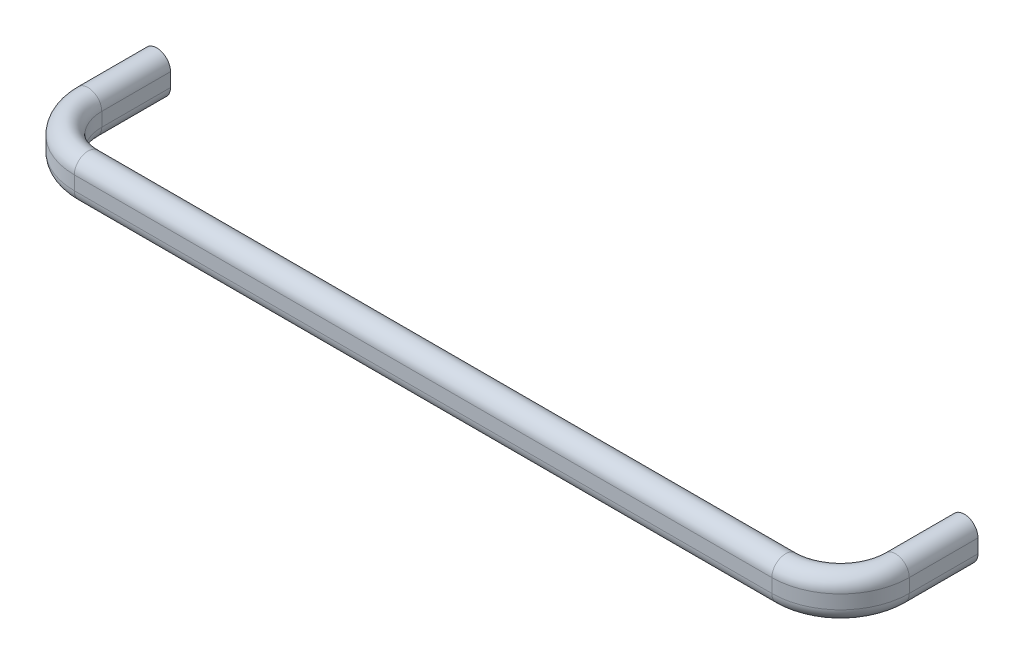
ISO-10303-21;
HEADER;
FILE_DESCRIPTION(('STEP AP214'),'2;1');
FILE_NAME('part.step','',(''),(''),'','','');
FILE_SCHEMA(('AUTOMOTIVE_DESIGN { 1 0 10303 214 1 1 1 1 }'));
ENDSEC;
DATA;
#1=APPLICATION_CONTEXT('core data for automotive mechanical design processes');
#2=APPLICATION_PROTOCOL_DEFINITION('international standard','automotive_design',2000,#1);
#3=PRODUCT_CONTEXT('',#1,'mechanical');
#4=PRODUCT('Part','Part','',(#3));
#5=PRODUCT_RELATED_PRODUCT_CATEGORY('part','',(#4));
#6=PRODUCT_DEFINITION_FORMATION('','',#4);
#7=PRODUCT_DEFINITION_CONTEXT('part definition',#1,'design');
#8=PRODUCT_DEFINITION('design','',#6,#7);
#9=PRODUCT_DEFINITION_SHAPE('','',#8);
#10=(LENGTH_UNIT() NAMED_UNIT(*) SI_UNIT(.MILLI.,.METRE.));
#11=(NAMED_UNIT(*) PLANE_ANGLE_UNIT() SI_UNIT($,.RADIAN.));
#12=(NAMED_UNIT(*) SI_UNIT($,.STERADIAN.) SOLID_ANGLE_UNIT());
#13=UNCERTAINTY_MEASURE_WITH_UNIT(LENGTH_MEASURE(1.E-05),#10,'distance_accuracy_value','');
#14=(GEOMETRIC_REPRESENTATION_CONTEXT(3) GLOBAL_UNCERTAINTY_ASSIGNED_CONTEXT((#13)) GLOBAL_UNIT_ASSIGNED_CONTEXT((#10,
#11,#12)) REPRESENTATION_CONTEXT('',''));
#15=CARTESIAN_POINT('',(0.,0.,0.));
#16=DIRECTION('',(0.,0.,1.));
#17=DIRECTION('',(1.,0.,0.));
#18=AXIS2_PLACEMENT_3D('',#15,#16,#17);
#19=CARTESIAN_POINT('',(0.,2.,0.));
#20=DIRECTION('',(0.,0.,-1.));
#21=DIRECTION('',(0.,1.,0.));
#22=AXIS2_PLACEMENT_3D('',#19,#20,#21);
#23=PLANE('',#22);
#24=CARTESIAN_POINT('',(0.,2.,0.));
#25=DIRECTION('',(0.,0.,-1.));
#26=DIRECTION('',(0.,1.,0.));
#27=AXIS2_PLACEMENT_3D('',#24,#25,#26);
#28=CIRCLE('',#27,4.);
#29=CARTESIAN_POINT('',(-4.,2.,0.));
#30=VERTEX_POINT('',#29);
#31=CARTESIAN_POINT('',(4.,2.,0.));
#32=VERTEX_POINT('',#31);
#33=EDGE_CURVE('E31',#30,#32,#28,.T.);
#34=ORIENTED_EDGE('',*,*,#33,.T.);
#35=DIRECTION('',(0.,-1.,0.));
#36=VECTOR('',#35,1.);
#37=CARTESIAN_POINT('',(4.,2.,0.));
#38=LINE('',#37,#36);
#39=CARTESIAN_POINT('',(4.,-2.,0.));
#40=VERTEX_POINT('',#39);
#41=EDGE_CURVE('E18',#32,#40,#38,.T.);
#42=ORIENTED_EDGE('',*,*,#41,.T.);
#43=CARTESIAN_POINT('',(0.,-2.,0.));
#44=DIRECTION('',(0.,0.,-1.));
#45=DIRECTION('',(0.,1.,0.));
#46=AXIS2_PLACEMENT_3D('',#43,#44,#45);
#47=CIRCLE('',#46,4.);
#48=CARTESIAN_POINT('',(-4.,-2.,0.));
#49=VERTEX_POINT('',#48);
#50=EDGE_CURVE('E39',#40,#49,#47,.T.);
#51=ORIENTED_EDGE('',*,*,#50,.T.);
#52=DIRECTION('',(0.,-1.,0.));
#53=VECTOR('',#52,1.);
#54=CARTESIAN_POINT('',(-4.,2.,0.));
#55=LINE('',#54,#53);
#56=EDGE_CURVE('E230',#30,#49,#55,.T.);
#57=ORIENTED_EDGE('',*,*,#56,.F.);
#58=EDGE_LOOP('',(#34,#42,#51,#57));
#59=FACE_BOUND('',#58,.T.);
#60=CARTESIAN_POINT('',(0.,0.,-2.48646182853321E-13));
#61=DIRECTION('',(0.,0.,-1.));
#62=DIRECTION('',(0.,1.,0.));
#63=AXIS2_PLACEMENT_3D('',#60,#61,#62);
#64=CIRCLE('',#63,2.96700000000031);
#65=CARTESIAN_POINT('',(0.,2.96700000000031,-2.48646182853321E-13));
#66=VERTEX_POINT('',#65);
#67=EDGE_CURVE('E542',#66,#66,#64,.T.);
#68=ORIENTED_EDGE('',*,*,#67,.F.);
#69=EDGE_LOOP('',(#68));
#70=FACE_BOUND('',#69,.T.);
#71=ADVANCED_FACE('F14',(#59,#70),#23,.T.);
#72=CARTESIAN_POINT('',(235.,2.,0.));
#73=DIRECTION('',(0.,0.,1.));
#74=DIRECTION('',(0.,1.,0.));
#75=AXIS2_PLACEMENT_3D('',#72,#73,#74);
#76=PLANE('',#75);
#77=CARTESIAN_POINT('',(235.,2.,0.));
#78=DIRECTION('',(0.,0.,1.));
#79=DIRECTION('',(0.,1.,0.));
#80=AXIS2_PLACEMENT_3D('',#77,#78,#79);
#81=CIRCLE('',#80,4.);
#82=CARTESIAN_POINT('',(239.,2.,0.));
#83=VERTEX_POINT('',#82);
#84=CARTESIAN_POINT('',(231.,2.,0.));
#85=VERTEX_POINT('',#84);
#86=EDGE_CURVE('E107',#83,#85,#81,.T.);
#87=ORIENTED_EDGE('',*,*,#86,.F.);
#88=DIRECTION('',(0.,-1.,0.));
#89=VECTOR('',#88,1.);
#90=CARTESIAN_POINT('',(239.,2.,0.));
#91=LINE('',#90,#89);
#92=CARTESIAN_POINT('',(239.,-2.,0.));
#93=VERTEX_POINT('',#92);
#94=EDGE_CURVE('E136',#83,#93,#91,.T.);
#95=ORIENTED_EDGE('',*,*,#94,.T.);
#96=CARTESIAN_POINT('',(235.,-2.,0.));
#97=DIRECTION('',(0.,0.,1.));
#98=DIRECTION('',(0.,1.,0.));
#99=AXIS2_PLACEMENT_3D('',#96,#97,#98);
#100=CIRCLE('',#99,4.);
#101=CARTESIAN_POINT('',(231.,-2.,0.));
#102=VERTEX_POINT('',#101);
#103=EDGE_CURVE('E134',#102,#93,#100,.T.);
#104=ORIENTED_EDGE('',*,*,#103,.F.);
#105=DIRECTION('',(0.,-1.,0.));
#106=VECTOR('',#105,1.);
#107=CARTESIAN_POINT('',(231.,2.,0.));
#108=LINE('',#107,#106);
#109=EDGE_CURVE('E119',#85,#102,#108,.T.);
#110=ORIENTED_EDGE('',*,*,#109,.F.);
#111=EDGE_LOOP('',(#87,#95,#104,#110));
#112=FACE_BOUND('',#111,.T.);
#113=CARTESIAN_POINT('',(235.,0.,-2.48646182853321E-13));
#114=DIRECTION('',(0.,0.,1.));
#115=DIRECTION('',(0.,1.,0.));
#116=AXIS2_PLACEMENT_3D('',#113,#114,#115);
#117=CIRCLE('',#116,2.96700000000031);
#118=CARTESIAN_POINT('',(235.,2.96700000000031,-2.48646182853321E-13));
#119=VERTEX_POINT('',#118);
#120=EDGE_CURVE('E120',#119,#119,#117,.T.);
#121=ORIENTED_EDGE('',*,*,#120,.T.);
#122=EDGE_LOOP('',(#121));
#123=FACE_BOUND('',#122,.T.);
#124=ADVANCED_FACE('F132',(#112,#123),#76,.F.);
#125=CARTESIAN_POINT('',(4.,2.,20.));
#126=DIRECTION('',(1.,0.,0.));
#127=DIRECTION('',(0.,1.,0.));
#128=AXIS2_PLACEMENT_3D('',#125,#126,#127);
#129=PLANE('',#128);
#130=DIRECTION('',(0.,-1.,0.));
#131=VECTOR('',#130,1.);
#132=CARTESIAN_POINT('',(4.,2.,20.));
#133=LINE('',#132,#131);
#134=CARTESIAN_POINT('',(4.,2.,20.));
#135=VERTEX_POINT('',#134);
#136=CARTESIAN_POINT('',(4.,-2.,20.));
#137=VERTEX_POINT('',#136);
#138=EDGE_CURVE('E204',#135,#137,#133,.T.);
#139=ORIENTED_EDGE('',*,*,#138,.T.);
#140=DIRECTION('',(0.,0.,-1.));
#141=VECTOR('',#140,1.);
#142=CARTESIAN_POINT('',(4.,-2.,20.));
#143=LINE('',#142,#141);
#144=EDGE_CURVE('E23',#137,#40,#143,.T.);
#145=ORIENTED_EDGE('',*,*,#144,.T.);
#146=ORIENTED_EDGE('',*,*,#41,.F.);
#147=DIRECTION('',(0.,0.,-1.));
#148=VECTOR('',#147,1.);
#149=CARTESIAN_POINT('',(4.,2.,20.));
#150=LINE('',#149,#148);
#151=EDGE_CURVE('E9',#135,#32,#150,.T.);
#152=ORIENTED_EDGE('',*,*,#151,.F.);
#153=EDGE_LOOP('',(#139,#145,#146,#152));
#154=FACE_BOUND('',#153,.T.);
#155=ADVANCED_FACE('F16',(#154),#129,.T.);
#156=CARTESIAN_POINT('',(0.,-2.,20.));
#157=DIRECTION('',(0.,0.,-1.));
#158=DIRECTION('',(0.,-1.,0.));
#159=AXIS2_PLACEMENT_3D('',#156,#157,#158);
#160=CYLINDRICAL_SURFACE('',#159,4.);
#161=CARTESIAN_POINT('',(0.,-2.,20.));
#162=DIRECTION('',(0.,0.,-1.));
#163=DIRECTION('',(0.,1.,0.));
#164=AXIS2_PLACEMENT_3D('',#161,#162,#163);
#165=CIRCLE('',#164,4.);
#166=CARTESIAN_POINT('',(-4.,-2.,20.));
#167=VERTEX_POINT('',#166);
#168=EDGE_CURVE('E217',#137,#167,#165,.T.);
#169=ORIENTED_EDGE('',*,*,#168,.T.);
#170=DIRECTION('',(0.,0.,-1.));
#171=VECTOR('',#170,1.);
#172=CARTESIAN_POINT('',(-4.,-2.,20.));
#173=LINE('',#172,#171);
#174=EDGE_CURVE('E225',#167,#49,#173,.T.);
#175=ORIENTED_EDGE('',*,*,#174,.T.);
#176=ORIENTED_EDGE('',*,*,#50,.F.);
#177=ORIENTED_EDGE('',*,*,#144,.F.);
#178=EDGE_LOOP('',(#169,#175,#176,#177));
#179=FACE_BOUND('',#178,.T.);
#180=ADVANCED_FACE('F235',(#179),#160,.T.);
#181=CARTESIAN_POINT('',(-4.,2.,20.));
#182=DIRECTION('',(1.,0.,0.));
#183=DIRECTION('',(0.,1.,0.));
#184=AXIS2_PLACEMENT_3D('',#181,#182,#183);
#185=PLANE('',#184);
#186=DIRECTION('',(0.,-1.,0.));
#187=VECTOR('',#186,1.);
#188=CARTESIAN_POINT('',(-4.,2.,20.));
#189=LINE('',#188,#187);
#190=CARTESIAN_POINT('',(-4.,2.,20.));
#191=VERTEX_POINT('',#190);
#192=EDGE_CURVE('E214',#191,#167,#189,.T.);
#193=ORIENTED_EDGE('',*,*,#192,.F.);
#194=DIRECTION('',(0.,0.,-1.));
#195=VECTOR('',#194,1.);
#196=CARTESIAN_POINT('',(-4.,2.,20.));
#197=LINE('',#196,#195);
#198=EDGE_CURVE('E222',#191,#30,#197,.T.);
#199=ORIENTED_EDGE('',*,*,#198,.T.);
#200=ORIENTED_EDGE('',*,*,#56,.T.);
#201=ORIENTED_EDGE('',*,*,#174,.F.);
#202=EDGE_LOOP('',(#193,#199,#200,#201));
#203=FACE_BOUND('',#202,.T.);
#204=ADVANCED_FACE('F292',(#203),#185,.F.);
#205=CARTESIAN_POINT('',(0.,2.,20.));
#206=DIRECTION('',(0.,0.,-1.));
#207=DIRECTION('',(0.,-1.,0.));
#208=AXIS2_PLACEMENT_3D('',#205,#206,#207);
#209=CYLINDRICAL_SURFACE('',#208,4.);
#210=CARTESIAN_POINT('',(0.,2.,20.));
#211=DIRECTION('',(0.,0.,-1.));
#212=DIRECTION('',(0.,1.,0.));
#213=AXIS2_PLACEMENT_3D('',#210,#211,#212);
#214=CIRCLE('',#213,4.);
#215=EDGE_CURVE('E190',#191,#135,#214,.T.);
#216=ORIENTED_EDGE('',*,*,#215,.T.);
#217=ORIENTED_EDGE('',*,*,#151,.T.);
#218=ORIENTED_EDGE('',*,*,#33,.F.);
#219=ORIENTED_EDGE('',*,*,#198,.F.);
#220=EDGE_LOOP('',(#216,#217,#218,#219));
#221=FACE_BOUND('',#220,.T.);
#222=ADVANCED_FACE('F283',(#221),#209,.T.);
#223=CARTESIAN_POINT('',(16.,0.,20.));
#224=DIRECTION('',(0.,-1.,0.));
#225=DIRECTION('',(1.,0.,0.));
#226=AXIS2_PLACEMENT_3D('',#223,#224,#225);
#227=CYLINDRICAL_SURFACE('',#226,12.);
#228=DIRECTION('',(0.,-1.,0.));
#229=VECTOR('',#228,1.);
#230=CARTESIAN_POINT('',(16.,2.,32.));
#231=LINE('',#230,#229);
#232=CARTESIAN_POINT('',(16.,2.,32.));
#233=VERTEX_POINT('',#232);
#234=CARTESIAN_POINT('',(16.,-2.,32.));
#235=VERTEX_POINT('',#234);
#236=EDGE_CURVE('E181',#233,#235,#231,.T.);
#237=ORIENTED_EDGE('',*,*,#236,.T.);
#238=CARTESIAN_POINT('',(16.,-2.,20.));
#239=DIRECTION('',(0.,-1.,0.));
#240=DIRECTION('',(1.,0.,0.));
#241=AXIS2_PLACEMENT_3D('',#238,#239,#240);
#242=CIRCLE('',#241,12.);
#243=EDGE_CURVE('E207',#235,#137,#242,.T.);
#244=ORIENTED_EDGE('',*,*,#243,.T.);
#245=ORIENTED_EDGE('',*,*,#138,.F.);
#246=CARTESIAN_POINT('',(16.,2.,20.));
#247=DIRECTION('',(0.,-1.,0.));
#248=DIRECTION('',(1.,0.,0.));
#249=AXIS2_PLACEMENT_3D('',#246,#247,#248);
#250=CIRCLE('',#249,12.);
#251=EDGE_CURVE('E210',#233,#135,#250,.T.);
#252=ORIENTED_EDGE('',*,*,#251,.F.);
#253=EDGE_LOOP('',(#237,#244,#245,#252));
#254=FACE_BOUND('',#253,.T.);
#255=ADVANCED_FACE('F281',(#254),#227,.F.);
#256=CARTESIAN_POINT('',(16.,-2.,20.));
#257=DIRECTION('',(0.,-1.,0.));
#258=DIRECTION('',(1.,0.,0.));
#259=AXIS2_PLACEMENT_3D('',#256,#257,#258);
#260=TOROIDAL_SURFACE('',#259,16.,4.);
#261=CARTESIAN_POINT('',(16.,-2.,36.));
#262=DIRECTION('',(-1.,0.,0.));
#263=DIRECTION('',(0.,1.,0.));
#264=AXIS2_PLACEMENT_3D('',#261,#262,#263);
#265=CIRCLE('',#264,4.);
#266=CARTESIAN_POINT('',(16.,-2.,40.));
#267=VERTEX_POINT('',#266);
#268=EDGE_CURVE('E195',#235,#267,#265,.T.);
#269=ORIENTED_EDGE('',*,*,#268,.T.);
#270=CARTESIAN_POINT('',(16.,-2.,20.));
#271=DIRECTION('',(0.,-1.,0.));
#272=DIRECTION('',(1.,0.,0.));
#273=AXIS2_PLACEMENT_3D('',#270,#271,#272);
#274=CIRCLE('',#273,20.);
#275=EDGE_CURVE('E203',#267,#167,#274,.T.);
#276=ORIENTED_EDGE('',*,*,#275,.T.);
#277=ORIENTED_EDGE('',*,*,#168,.F.);
#278=ORIENTED_EDGE('',*,*,#243,.F.);
#279=EDGE_LOOP('',(#269,#276,#277,#278));
#280=FACE_BOUND('',#279,.T.);
#281=ADVANCED_FACE('F244',(#280),#260,.T.);
#282=CARTESIAN_POINT('',(16.,0.,20.));
#283=DIRECTION('',(0.,-1.,0.));
#284=DIRECTION('',(1.,0.,0.));
#285=AXIS2_PLACEMENT_3D('',#282,#283,#284);
#286=CYLINDRICAL_SURFACE('',#285,20.);
#287=DIRECTION('',(0.,-1.,0.));
#288=VECTOR('',#287,1.);
#289=CARTESIAN_POINT('',(16.,2.,40.));
#290=LINE('',#289,#288);
#291=CARTESIAN_POINT('',(16.,2.,40.));
#292=VERTEX_POINT('',#291);
#293=EDGE_CURVE('E192',#292,#267,#290,.T.);
#294=ORIENTED_EDGE('',*,*,#293,.F.);
#295=CARTESIAN_POINT('',(16.,2.,20.));
#296=DIRECTION('',(0.,-1.,0.));
#297=DIRECTION('',(1.,0.,0.));
#298=AXIS2_PLACEMENT_3D('',#295,#296,#297);
#299=CIRCLE('',#298,20.);
#300=EDGE_CURVE('E200',#292,#191,#299,.T.);
#301=ORIENTED_EDGE('',*,*,#300,.T.);
#302=ORIENTED_EDGE('',*,*,#192,.T.);
#303=ORIENTED_EDGE('',*,*,#275,.F.);
#304=EDGE_LOOP('',(#294,#301,#302,#303));
#305=FACE_BOUND('',#304,.T.);
#306=ADVANCED_FACE('F241',(#305),#286,.T.);
#307=CARTESIAN_POINT('',(16.,2.,20.));
#308=DIRECTION('',(0.,-1.,0.));
#309=DIRECTION('',(1.,0.,0.));
#310=AXIS2_PLACEMENT_3D('',#307,#308,#309);
#311=TOROIDAL_SURFACE('',#310,16.,4.);
#312=CARTESIAN_POINT('',(16.,2.,36.));
#313=DIRECTION('',(-1.,0.,0.));
#314=DIRECTION('',(0.,1.,0.));
#315=AXIS2_PLACEMENT_3D('',#312,#313,#314);
#316=CIRCLE('',#315,4.);
#317=EDGE_CURVE('E167',#292,#233,#316,.T.);
#318=ORIENTED_EDGE('',*,*,#317,.T.);
#319=ORIENTED_EDGE('',*,*,#251,.T.);
#320=ORIENTED_EDGE('',*,*,#215,.F.);
#321=ORIENTED_EDGE('',*,*,#300,.F.);
#322=EDGE_LOOP('',(#318,#319,#320,#321));
#323=FACE_BOUND('',#322,.T.);
#324=ADVANCED_FACE('F279',(#323),#311,.T.);
#325=CARTESIAN_POINT('',(219.,2.,32.));
#326=DIRECTION('',(0.,0.,-1.));
#327=DIRECTION('',(-1.,0.,0.));
#328=AXIS2_PLACEMENT_3D('',#325,#326,#327);
#329=PLANE('',#328);
#330=DIRECTION('',(0.,-1.,0.));
#331=VECTOR('',#330,1.);
#332=CARTESIAN_POINT('',(219.,2.,32.));
#333=LINE('',#332,#331);
#334=CARTESIAN_POINT('',(219.,2.,32.));
#335=VERTEX_POINT('',#334);
#336=CARTESIAN_POINT('',(219.,-2.,32.));
#337=VERTEX_POINT('',#336);
#338=EDGE_CURVE('E158',#335,#337,#333,.T.);
#339=ORIENTED_EDGE('',*,*,#338,.T.);
#340=DIRECTION('',(-1.,0.,0.));
#341=VECTOR('',#340,1.);
#342=CARTESIAN_POINT('',(219.,-2.,32.));
#343=LINE('',#342,#341);
#344=EDGE_CURVE('E184',#337,#235,#343,.T.);
#345=ORIENTED_EDGE('',*,*,#344,.T.);
#346=ORIENTED_EDGE('',*,*,#236,.F.);
#347=DIRECTION('',(-1.,0.,0.));
#348=VECTOR('',#347,1.);
#349=CARTESIAN_POINT('',(219.,2.,32.));
#350=LINE('',#349,#348);
#351=EDGE_CURVE('E187',#335,#233,#350,.T.);
#352=ORIENTED_EDGE('',*,*,#351,.F.);
#353=EDGE_LOOP('',(#339,#345,#346,#352));
#354=FACE_BOUND('',#353,.T.);
#355=ADVANCED_FACE('F273',(#354),#329,.T.);
#356=CARTESIAN_POINT('',(219.,-2.,36.));
#357=DIRECTION('',(-1.,0.,0.));
#358=DIRECTION('',(0.,0.,1.));
#359=AXIS2_PLACEMENT_3D('',#356,#357,#358);
#360=CYLINDRICAL_SURFACE('',#359,4.);
#361=CARTESIAN_POINT('',(219.,-2.,36.));
#362=DIRECTION('',(-1.,0.,0.));
#363=DIRECTION('',(0.,1.,0.));
#364=AXIS2_PLACEMENT_3D('',#361,#362,#363);
#365=CIRCLE('',#364,4.);
#366=CARTESIAN_POINT('',(219.,-2.,40.));
#367=VERTEX_POINT('',#366);
#368=EDGE_CURVE('E172',#337,#367,#365,.T.);
#369=ORIENTED_EDGE('',*,*,#368,.T.);
#370=DIRECTION('',(-1.,0.,0.));
#371=VECTOR('',#370,1.);
#372=CARTESIAN_POINT('',(219.,-2.,40.));
#373=LINE('',#372,#371);
#374=EDGE_CURVE('E180',#367,#267,#373,.T.);
#375=ORIENTED_EDGE('',*,*,#374,.T.);
#376=ORIENTED_EDGE('',*,*,#268,.F.);
#377=ORIENTED_EDGE('',*,*,#344,.F.);
#378=EDGE_LOOP('',(#369,#375,#376,#377));
#379=FACE_BOUND('',#378,.T.);
#380=ADVANCED_FACE('F251',(#379),#360,.T.);
#381=CARTESIAN_POINT('',(219.,2.,40.));
#382=DIRECTION('',(0.,0.,-1.));
#383=DIRECTION('',(-1.,0.,0.));
#384=AXIS2_PLACEMENT_3D('',#381,#382,#383);
#385=PLANE('',#384);
#386=DIRECTION('',(0.,-1.,0.));
#387=VECTOR('',#386,1.);
#388=CARTESIAN_POINT('',(219.,2.,40.));
#389=LINE('',#388,#387);
#390=CARTESIAN_POINT('',(219.,2.,40.));
#391=VERTEX_POINT('',#390);
#392=EDGE_CURVE('E169',#391,#367,#389,.T.);
#393=ORIENTED_EDGE('',*,*,#392,.F.);
#394=DIRECTION('',(-1.,0.,0.));
#395=VECTOR('',#394,1.);
#396=CARTESIAN_POINT('',(219.,2.,40.));
#397=LINE('',#396,#395);
#398=EDGE_CURVE('E177',#391,#292,#397,.T.);
#399=ORIENTED_EDGE('',*,*,#398,.T.);
#400=ORIENTED_EDGE('',*,*,#293,.T.);
#401=ORIENTED_EDGE('',*,*,#374,.F.);
#402=EDGE_LOOP('',(#393,#399,#400,#401));
#403=FACE_BOUND('',#402,.T.);
#404=ADVANCED_FACE('F249',(#403),#385,.F.);
#405=CARTESIAN_POINT('',(219.,2.,36.));
#406=DIRECTION('',(-1.,0.,0.));
#407=DIRECTION('',(0.,0.,1.));
#408=AXIS2_PLACEMENT_3D('',#405,#406,#407);
#409=CYLINDRICAL_SURFACE('',#408,4.);
#410=CARTESIAN_POINT('',(219.,2.,36.));
#411=DIRECTION('',(-1.,0.,0.));
#412=DIRECTION('',(0.,1.,0.));
#413=AXIS2_PLACEMENT_3D('',#410,#411,#412);
#414=CIRCLE('',#413,4.);
#415=EDGE_CURVE('E129',#391,#335,#414,.T.);
#416=ORIENTED_EDGE('',*,*,#415,.T.);
#417=ORIENTED_EDGE('',*,*,#351,.T.);
#418=ORIENTED_EDGE('',*,*,#317,.F.);
#419=ORIENTED_EDGE('',*,*,#398,.F.);
#420=EDGE_LOOP('',(#416,#417,#418,#419));
#421=FACE_BOUND('',#420,.T.);
#422=ADVANCED_FACE('F276',(#421),#409,.T.);
#423=CARTESIAN_POINT('',(219.,0.,20.));
#424=DIRECTION('',(0.,-1.,0.));
#425=DIRECTION('',(1.,0.,0.));
#426=AXIS2_PLACEMENT_3D('',#423,#424,#425);
#427=CYLINDRICAL_SURFACE('',#426,12.);
#428=DIRECTION('',(0.,-1.,0.));
#429=VECTOR('',#428,1.);
#430=CARTESIAN_POINT('',(231.,2.,20.));
#431=LINE('',#430,#429);
#432=CARTESIAN_POINT('',(231.,2.,20.));
#433=VERTEX_POINT('',#432);
#434=CARTESIAN_POINT('',(231.,-2.,20.));
#435=VERTEX_POINT('',#434);
#436=EDGE_CURVE('E128',#433,#435,#431,.T.);
#437=ORIENTED_EDGE('',*,*,#436,.T.);
#438=CARTESIAN_POINT('',(219.,-2.,20.));
#439=DIRECTION('',(0.,-1.,0.));
#440=DIRECTION('',(1.,0.,0.));
#441=AXIS2_PLACEMENT_3D('',#438,#439,#440);
#442=CIRCLE('',#441,12.);
#443=EDGE_CURVE('E161',#435,#337,#442,.T.);
#444=ORIENTED_EDGE('',*,*,#443,.T.);
#445=ORIENTED_EDGE('',*,*,#338,.F.);
#446=CARTESIAN_POINT('',(219.,2.,20.));
#447=DIRECTION('',(0.,-1.,0.));
#448=DIRECTION('',(1.,0.,0.));
#449=AXIS2_PLACEMENT_3D('',#446,#447,#448);
#450=CIRCLE('',#449,12.);
#451=EDGE_CURVE('E164',#433,#335,#450,.T.);
#452=ORIENTED_EDGE('',*,*,#451,.F.);
#453=EDGE_LOOP('',(#437,#444,#445,#452));
#454=FACE_BOUND('',#453,.T.);
#455=ADVANCED_FACE('F270',(#454),#427,.F.);
#456=CARTESIAN_POINT('',(219.,-2.,20.));
#457=DIRECTION('',(0.,-1.,0.));
#458=DIRECTION('',(1.,0.,0.));
#459=AXIS2_PLACEMENT_3D('',#456,#457,#458);
#460=TOROIDAL_SURFACE('',#459,16.,4.);
#461=CARTESIAN_POINT('',(235.,-2.,20.));
#462=DIRECTION('',(0.,0.,1.));
#463=DIRECTION('',(0.,1.,0.));
#464=AXIS2_PLACEMENT_3D('',#461,#462,#463);
#465=CIRCLE('',#464,4.);
#466=CARTESIAN_POINT('',(239.,-2.,20.));
#467=VERTEX_POINT('',#466);
#468=EDGE_CURVE('E144',#435,#467,#465,.T.);
#469=ORIENTED_EDGE('',*,*,#468,.T.);
#470=CARTESIAN_POINT('',(219.,-2.,20.));
#471=DIRECTION('',(0.,-1.,0.));
#472=DIRECTION('',(1.,0.,0.));
#473=AXIS2_PLACEMENT_3D('',#470,#471,#472);
#474=CIRCLE('',#473,20.);
#475=EDGE_CURVE('E157',#467,#367,#474,.T.);
#476=ORIENTED_EDGE('',*,*,#475,.T.);
#477=ORIENTED_EDGE('',*,*,#368,.F.);
#478=ORIENTED_EDGE('',*,*,#443,.F.);
#479=EDGE_LOOP('',(#469,#476,#477,#478));
#480=FACE_BOUND('',#479,.T.);
#481=ADVANCED_FACE('F259',(#480),#460,.T.);
#482=CARTESIAN_POINT('',(219.,0.,20.));
#483=DIRECTION('',(0.,-1.,0.));
#484=DIRECTION('',(1.,0.,0.));
#485=AXIS2_PLACEMENT_3D('',#482,#483,#484);
#486=CYLINDRICAL_SURFACE('',#485,20.);
#487=DIRECTION('',(0.,-1.,0.));
#488=VECTOR('',#487,1.);
#489=CARTESIAN_POINT('',(239.,2.,20.));
#490=LINE('',#489,#488);
#491=CARTESIAN_POINT('',(239.,2.,20.));
#492=VERTEX_POINT('',#491);
#493=EDGE_CURVE('E146',#492,#467,#490,.T.);
#494=ORIENTED_EDGE('',*,*,#493,.F.);
#495=CARTESIAN_POINT('',(219.,2.,20.));
#496=DIRECTION('',(0.,-1.,0.));
#497=DIRECTION('',(1.,0.,0.));
#498=AXIS2_PLACEMENT_3D('',#495,#496,#497);
#499=CIRCLE('',#498,20.);
#500=EDGE_CURVE('E154',#492,#391,#499,.T.);
#501=ORIENTED_EDGE('',*,*,#500,.T.);
#502=ORIENTED_EDGE('',*,*,#392,.T.);
#503=ORIENTED_EDGE('',*,*,#475,.F.);
#504=EDGE_LOOP('',(#494,#501,#502,#503));
#505=FACE_BOUND('',#504,.T.);
#506=ADVANCED_FACE('F256',(#505),#486,.T.);
#507=CARTESIAN_POINT('',(219.,2.,20.));
#508=DIRECTION('',(0.,-1.,0.));
#509=DIRECTION('',(1.,0.,0.));
#510=AXIS2_PLACEMENT_3D('',#507,#508,#509);
#511=TOROIDAL_SURFACE('',#510,16.,4.);
#512=CARTESIAN_POINT('',(235.,2.,20.));
#513=DIRECTION('',(0.,0.,1.));
#514=DIRECTION('',(0.,1.,0.));
#515=AXIS2_PLACEMENT_3D('',#512,#513,#514);
#516=CIRCLE('',#515,4.);
#517=EDGE_CURVE('E141',#492,#433,#516,.T.);
#518=ORIENTED_EDGE('',*,*,#517,.T.);
#519=ORIENTED_EDGE('',*,*,#451,.T.);
#520=ORIENTED_EDGE('',*,*,#415,.F.);
#521=ORIENTED_EDGE('',*,*,#500,.F.);
#522=EDGE_LOOP('',(#518,#519,#520,#521));
#523=FACE_BOUND('',#522,.T.);
#524=ADVANCED_FACE('F267',(#523),#511,.T.);
#525=CARTESIAN_POINT('',(235.,2.,20.));
#526=DIRECTION('',(0.,0.,-1.));
#527=DIRECTION('',(0.,-1.,0.));
#528=AXIS2_PLACEMENT_3D('',#525,#526,#527);
#529=CYLINDRICAL_SURFACE('',#528,4.);
#530=DIRECTION('',(0.,0.,-1.));
#531=VECTOR('',#530,1.);
#532=CARTESIAN_POINT('',(231.,2.,20.));
#533=LINE('',#532,#531);
#534=EDGE_CURVE('E111',#433,#85,#533,.T.);
#535=ORIENTED_EDGE('',*,*,#534,.F.);
#536=ORIENTED_EDGE('',*,*,#517,.F.);
#537=DIRECTION('',(0.,0.,-1.));
#538=VECTOR('',#537,1.);
#539=CARTESIAN_POINT('',(239.,2.,20.));
#540=LINE('',#539,#538);
#541=EDGE_CURVE('E114',#492,#83,#540,.T.);
#542=ORIENTED_EDGE('',*,*,#541,.T.);
#543=ORIENTED_EDGE('',*,*,#86,.T.);
#544=EDGE_LOOP('',(#535,#536,#542,#543));
#545=FACE_BOUND('',#544,.T.);
#546=ADVANCED_FACE('F109',(#545),#529,.T.);
#547=CARTESIAN_POINT('',(231.,2.,20.));
#548=DIRECTION('',(1.,0.,0.));
#549=DIRECTION('',(0.,1.,0.));
#550=AXIS2_PLACEMENT_3D('',#547,#548,#549);
#551=PLANE('',#550);
#552=DIRECTION('',(0.,0.,-1.));
#553=VECTOR('',#552,1.);
#554=CARTESIAN_POINT('',(231.,-2.,20.));
#555=LINE('',#554,#553);
#556=EDGE_CURVE('E130',#435,#102,#555,.T.);
#557=ORIENTED_EDGE('',*,*,#556,.F.);
#558=ORIENTED_EDGE('',*,*,#436,.F.);
#559=ORIENTED_EDGE('',*,*,#534,.T.);
#560=ORIENTED_EDGE('',*,*,#109,.T.);
#561=EDGE_LOOP('',(#557,#558,#559,#560));
#562=FACE_BOUND('',#561,.T.);
#563=ADVANCED_FACE('F125',(#562),#551,.F.);
#564=CARTESIAN_POINT('',(235.,-2.,20.));
#565=DIRECTION('',(0.,0.,-1.));
#566=DIRECTION('',(0.,-1.,0.));
#567=AXIS2_PLACEMENT_3D('',#564,#565,#566);
#568=CYLINDRICAL_SURFACE('',#567,4.);
#569=DIRECTION('',(0.,0.,-1.));
#570=VECTOR('',#569,1.);
#571=CARTESIAN_POINT('',(239.,-2.,20.));
#572=LINE('',#571,#570);
#573=EDGE_CURVE('E150',#467,#93,#572,.T.);
#574=ORIENTED_EDGE('',*,*,#573,.F.);
#575=ORIENTED_EDGE('',*,*,#468,.F.);
#576=ORIENTED_EDGE('',*,*,#556,.T.);
#577=ORIENTED_EDGE('',*,*,#103,.T.);
#578=EDGE_LOOP('',(#574,#575,#576,#577));
#579=FACE_BOUND('',#578,.T.);
#580=ADVANCED_FACE('F262',(#579),#568,.T.);
#581=CARTESIAN_POINT('',(239.,2.,20.));
#582=DIRECTION('',(1.,0.,0.));
#583=DIRECTION('',(0.,1.,0.));
#584=AXIS2_PLACEMENT_3D('',#581,#582,#583);
#585=PLANE('',#584);
#586=ORIENTED_EDGE('',*,*,#493,.T.);
#587=ORIENTED_EDGE('',*,*,#573,.T.);
#588=ORIENTED_EDGE('',*,*,#94,.F.);
#589=ORIENTED_EDGE('',*,*,#541,.F.);
#590=EDGE_LOOP('',(#586,#587,#588,#589));
#591=FACE_BOUND('',#590,.T.);
#592=ADVANCED_FACE('F264',(#591),#585,.T.);
#593=CARTESIAN_POINT('',(235.,0.,-2.48646182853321E-13));
#594=DIRECTION('',(0.,0.,-1.));
#595=DIRECTION('',(0.,-1.,0.));
#596=AXIS2_PLACEMENT_3D('',#593,#594,#595);
#597=CONICAL_SURFACE('',#596,2.96700000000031,0.785398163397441);
#598=CARTESIAN_POINT('',(235.,0.,0.467000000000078));
#599=DIRECTION('',(0.,0.,-1.));
#600=DIRECTION('',(-1.,0.,0.));
#601=AXIS2_PLACEMENT_3D('',#598,#599,#600);
#602=CIRCLE('',#601,2.5);
#603=CARTESIAN_POINT('',(232.5,0.,0.467000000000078));
#604=VERTEX_POINT('',#603);
#605=EDGE_CURVE('E539',#604,#604,#602,.T.);
#606=ORIENTED_EDGE('',*,*,#605,.F.);
#607=EDGE_LOOP('',(#606));
#608=FACE_BOUND('',#607,.T.);
#609=ORIENTED_EDGE('',*,*,#120,.F.);
#610=EDGE_LOOP('',(#609));
#611=FACE_BOUND('',#610,.T.);
#612=ADVANCED_FACE('F306',(#608,#611),#597,.F.);
#613=CARTESIAN_POINT('',(0.,0.,-2.48646182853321E-13));
#614=DIRECTION('',(0.,0.,-1.));
#615=DIRECTION('',(0.,-1.,0.));
#616=AXIS2_PLACEMENT_3D('',#613,#614,#615);
#617=CONICAL_SURFACE('',#616,2.96700000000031,0.785398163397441);
#618=CARTESIAN_POINT('',(0.,0.,0.467000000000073));
#619=DIRECTION('',(0.,0.,-1.));
#620=DIRECTION('',(-1.,0.,0.));
#621=AXIS2_PLACEMENT_3D('',#618,#619,#620);
#622=CIRCLE('',#621,2.5);
#623=CARTESIAN_POINT('',(-2.5,0.,0.467000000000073));
#624=VERTEX_POINT('',#623);
#625=EDGE_CURVE('E531',#624,#624,#622,.T.);
#626=ORIENTED_EDGE('',*,*,#625,.F.);
#627=EDGE_LOOP('',(#626));
#628=FACE_BOUND('',#627,.T.);
#629=ORIENTED_EDGE('',*,*,#67,.T.);
#630=EDGE_LOOP('',(#629));
#631=FACE_BOUND('',#630,.T.);
#632=ADVANCED_FACE('F414',(#628,#631),#617,.F.);
#633=CARTESIAN_POINT('',(235.,0.,10.));
#634=DIRECTION('',(0.,0.,-1.));
#635=DIRECTION('',(-1.,0.,0.));
#636=AXIS2_PLACEMENT_3D('',#633,#634,#635);
#637=CYLINDRICAL_SURFACE('',#636,2.5);
#638=ORIENTED_EDGE('',*,*,#605,.T.);
#639=EDGE_LOOP('',(#638));
#640=FACE_BOUND('',#639,.T.);
#641=CARTESIAN_POINT('',(235.,0.,10.));
#642=DIRECTION('',(0.,0.,-1.));
#643=DIRECTION('',(-1.,0.,0.));
#644=AXIS2_PLACEMENT_3D('',#641,#642,#643);
#645=CIRCLE('',#644,2.5);
#646=CARTESIAN_POINT('',(232.5,0.,10.));
#647=VERTEX_POINT('',#646);
#648=EDGE_CURVE('E534',#647,#647,#645,.T.);
#649=ORIENTED_EDGE('',*,*,#648,.F.);
#650=EDGE_LOOP('',(#649));
#651=FACE_BOUND('',#650,.T.);
#652=ADVANCED_FACE('F422',(#640,#651),#637,.F.);
#653=CARTESIAN_POINT('',(235.,0.,10.));
#654=DIRECTION('',(0.,0.,-1.));
#655=DIRECTION('',(-1.,0.,0.));
#656=AXIS2_PLACEMENT_3D('',#653,#654,#655);
#657=PLANE('',#656);
#658=ORIENTED_EDGE('',*,*,#648,.T.);
#659=EDGE_LOOP('',(#658));
#660=FACE_BOUND('',#659,.T.);
#661=ADVANCED_FACE('F431',(#660),#657,.T.);
#662=CARTESIAN_POINT('',(0.,0.,10.));
#663=DIRECTION('',(0.,0.,-1.));
#664=DIRECTION('',(-1.,0.,0.));
#665=AXIS2_PLACEMENT_3D('',#662,#663,#664);
#666=CYLINDRICAL_SURFACE('',#665,2.5);
#667=ORIENTED_EDGE('',*,*,#625,.T.);
#668=EDGE_LOOP('',(#667));
#669=FACE_BOUND('',#668,.T.);
#670=CARTESIAN_POINT('',(0.,0.,10.));
#671=DIRECTION('',(0.,0.,-1.));
#672=DIRECTION('',(-1.,0.,0.));
#673=AXIS2_PLACEMENT_3D('',#670,#671,#672);
#674=CIRCLE('',#673,2.5);
#675=CARTESIAN_POINT('',(-2.5,0.,10.));
#676=VERTEX_POINT('',#675);
#677=EDGE_CURVE('E529',#676,#676,#674,.T.);
#678=ORIENTED_EDGE('',*,*,#677,.F.);
#679=EDGE_LOOP('',(#678));
#680=FACE_BOUND('',#679,.T.);
#681=ADVANCED_FACE('F440',(#669,#680),#666,.F.);
#682=CARTESIAN_POINT('',(0.,0.,10.));
#683=DIRECTION('',(0.,0.,-1.));
#684=DIRECTION('',(-1.,0.,0.));
#685=AXIS2_PLACEMENT_3D('',#682,#683,#684);
#686=PLANE('',#685);
#687=ORIENTED_EDGE('',*,*,#677,.T.);
#688=EDGE_LOOP('',(#687));
#689=FACE_BOUND('',#688,.T.);
#690=ADVANCED_FACE('F449',(#689),#686,.T.);
#691=CLOSED_SHELL('',(#71,#124,#155,#180,#204,#222,#255,#281,#306,#324,#355,#380,#404,#422,#455,
#481,#506,#524,#546,#563,#580,#592,#612,#632,#652,#661,#681,#690));
#692=MANIFOLD_SOLID_BREP('B1',#691);
#693=ADVANCED_BREP_SHAPE_REPRESENTATION('',(#18,#692),#14);
#694=SHAPE_DEFINITION_REPRESENTATION(#9,#693);
ENDSEC;
END-ISO-10303-21;
